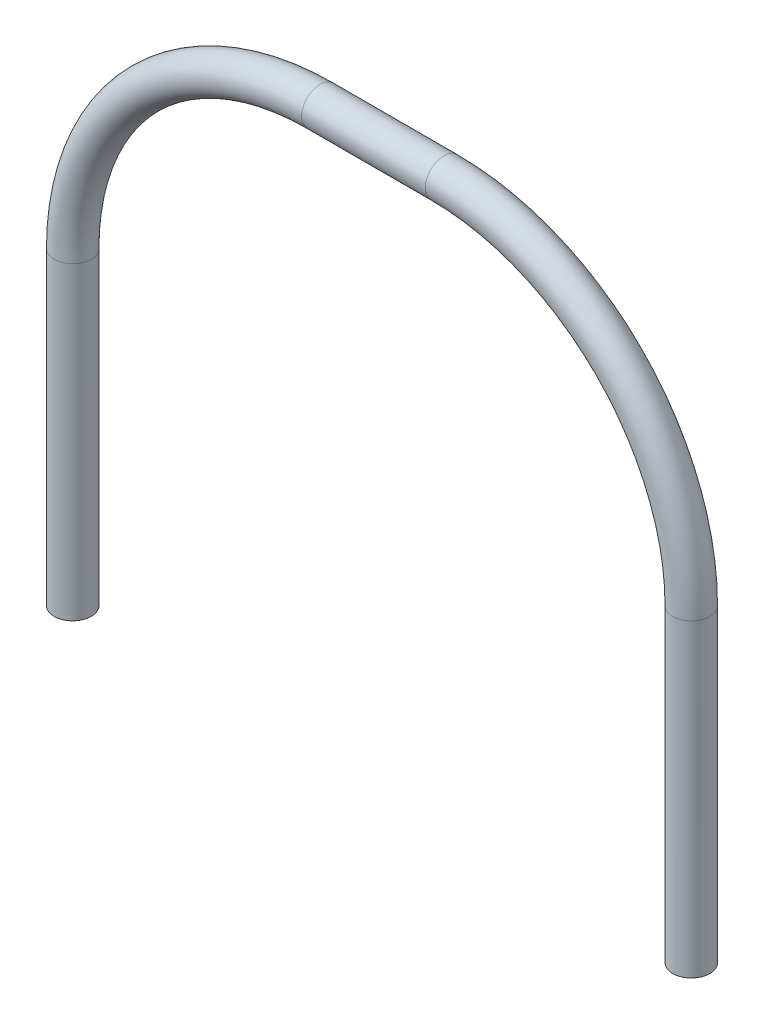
from build123d import *

# Parameters (mm, degrees)
ESQUISSE1_R = 0.15


with BuildPart() as part:
    # Balayage1: sweep along a path in Esquisse2
    with BuildLine(Plane.XY) as balayage1_path:
        Line((0, 0), (0, 2.5))
        ThreePointArc((0, 2.5), (0.585786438, 3.914213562), (2, 4.5))
        Line((2, 4.5), (3, 4.5))
        ThreePointArc((3, 4.5), (4.414213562, 3.914213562), (5, 2.5))
        Line((5, 2.5), (5, 0))
    # Esquisse1 → Balayage1 (sweep)
    with BuildSketch(Plane(origin=(0, 0, 0), x_dir=(1, 0, 0), z_dir=(0, 1, 0))):
        Circle(ESQUISSE1_R)
    sweep(path=balayage1_path.line)


solid = part.part
